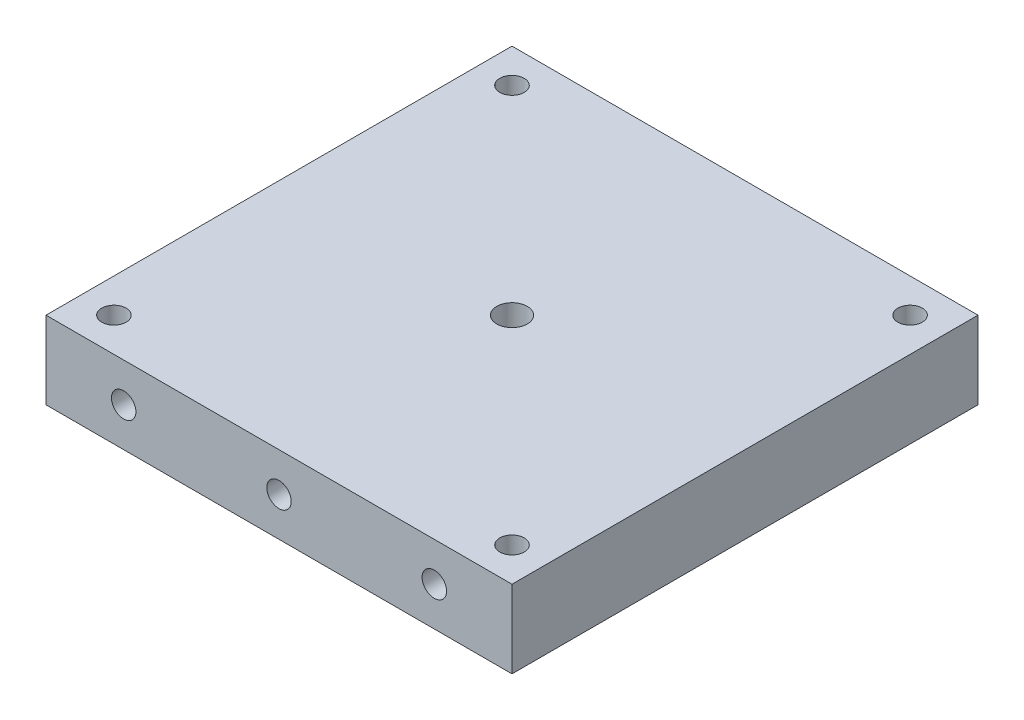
from build123d import *

# Parameters (mm, degrees)
SKETCH1_W                    = 76.2
SKETCH1_H                    = 76.2
BOSS_EXTRUDE1_DEPTH          = 12.7
F_5_0_5_DIAMETER_HOLE1_D     = 5
SKETCH5_R                    = 2
CUT_EXTRUDE1_DEPTH           = 25.4
F_4_0_4_DIAMETER_HOLE1_D     = 4
F_4_0_4_DIAMETER_HOLE1_DEPTH = 6.35
F_4_0_4_DIAMETER_HOLE1_TIP   = 1.201721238


with BuildPart() as part:
    # Sketch1 → Boss-Extrude1 (new body)
    with BuildSketch(Plane(origin=(0, 0, 0), x_dir=(1, 0, 0), z_dir=(0, 1, 0))):
        with Locations((-26.4530389, -20.658092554)):
            Rectangle(SKETCH1_W, SKETCH1_H)
    extrude(amount=BOSS_EXTRUDE1_DEPTH)

    # 5.0 _5_ Diameter Hole1 (through all)
    with Locations(Plane(origin=(-26.4530389, 12.7, 20.658092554), x_dir=(0, 0, 1), z_dir=(0, 1, 0))):
        with Locations((0, 0)):
            Hole(F_5_0_5_DIAMETER_HOLE1_D / 2)

    # Sketch5 → Cut-Extrude1 (cut)
    with BuildSketch(Plane.XY.offset(58.758092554)):
        with Locations((-51.8530389, 6.35)):
            Circle(SKETCH5_R)
        with Locations((-26.4530389, 6.35)):
            Circle(SKETCH5_R)
        with Locations((-1.0530389, 6.35)):
            Circle(SKETCH5_R)
    extrude(amount=-CUT_EXTRUDE1_DEPTH, mode=Mode.SUBTRACT)

    # 4.0 _4_ Diameter Hole1
    with Locations(Plane(origin=(-58.9967889, 12.7, -11.885657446), x_dir=(0, 0, 1), z_dir=(0, 1, 0))):
        with Locations((0, 0), (0, 65.0875), (65.0875, 65.0875), (65.0875, 0)):
            Hole(F_4_0_4_DIAMETER_HOLE1_D / 2, depth=F_4_0_4_DIAMETER_HOLE1_DEPTH)
            with Locations((0, 0, -(F_4_0_4_DIAMETER_HOLE1_DEPTH + F_4_0_4_DIAMETER_HOLE1_TIP / 2))):  # 118° drill point
                Cone(0, F_4_0_4_DIAMETER_HOLE1_D / 2, F_4_0_4_DIAMETER_HOLE1_TIP, mode=Mode.SUBTRACT)


solid = part.part
